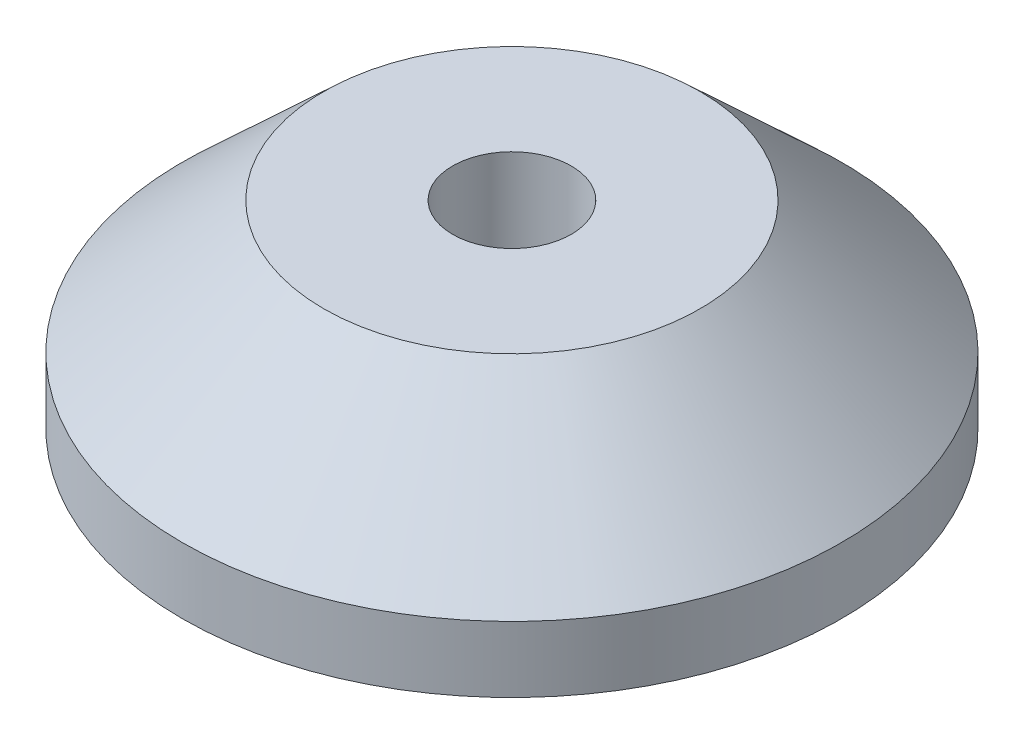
ISO-10303-21;
HEADER;
FILE_DESCRIPTION(('STEP AP214'),'2;1');
FILE_NAME('part.step','',(''),(''),'','','');
FILE_SCHEMA(('AUTOMOTIVE_DESIGN { 1 0 10303 214 1 1 1 1 }'));
ENDSEC;
DATA;
#1=APPLICATION_CONTEXT('core data for automotive mechanical design processes');
#2=APPLICATION_PROTOCOL_DEFINITION('international standard','automotive_design',2000,#1);
#3=PRODUCT_CONTEXT('',#1,'mechanical');
#4=PRODUCT('Part','Part','',(#3));
#5=PRODUCT_RELATED_PRODUCT_CATEGORY('part','',(#4));
#6=PRODUCT_DEFINITION_FORMATION('','',#4);
#7=PRODUCT_DEFINITION_CONTEXT('part definition',#1,'design');
#8=PRODUCT_DEFINITION('design','',#6,#7);
#9=PRODUCT_DEFINITION_SHAPE('','',#8);
#10=(LENGTH_UNIT() NAMED_UNIT(*) SI_UNIT(.MILLI.,.METRE.));
#11=(NAMED_UNIT(*) PLANE_ANGLE_UNIT() SI_UNIT($,.RADIAN.));
#12=(NAMED_UNIT(*) SI_UNIT($,.STERADIAN.) SOLID_ANGLE_UNIT());
#13=UNCERTAINTY_MEASURE_WITH_UNIT(LENGTH_MEASURE(1.E-05),#10,'distance_accuracy_value','');
#14=(GEOMETRIC_REPRESENTATION_CONTEXT(3) GLOBAL_UNCERTAINTY_ASSIGNED_CONTEXT((#13)) GLOBAL_UNIT_ASSIGNED_CONTEXT((#10,
#11,#12)) REPRESENTATION_CONTEXT('',''));
#15=CARTESIAN_POINT('',(0.,0.,0.));
#16=DIRECTION('',(0.,0.,1.));
#17=DIRECTION('',(1.,0.,0.));
#18=AXIS2_PLACEMENT_3D('',#15,#16,#17);
#19=CARTESIAN_POINT('',(0.,10.,0.));
#20=DIRECTION('',(0.,-1.,0.));
#21=DIRECTION('',(0.,0.,1.));
#22=AXIS2_PLACEMENT_3D('',#19,#20,#21);
#23=CONICAL_SURFACE('',#22,50.,0.820304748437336);
#24=CARTESIAN_POINT('',(0.,10.,0.));
#25=DIRECTION('',(0.,1.,0.));
#26=DIRECTION('',(0.,0.,1.));
#27=AXIS2_PLACEMENT_3D('',#24,#25,#26);
#28=CIRCLE('',#27,50.);
#29=CARTESIAN_POINT('',(0.,10.,50.));
#30=VERTEX_POINT('',#29);
#31=EDGE_CURVE('E10',#30,#30,#28,.T.);
#32=ORIENTED_EDGE('',*,*,#31,.T.);
#33=EDGE_LOOP('',(#32));
#34=FACE_BOUND('',#33,.T.);
#35=CARTESIAN_POINT('',(0.,30.,0.));
#36=DIRECTION('',(0.,1.,0.));
#37=DIRECTION('',(0.,0.,1.));
#38=AXIS2_PLACEMENT_3D('',#35,#36,#37);
#39=CIRCLE('',#38,28.5526257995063);
#40=CARTESIAN_POINT('',(0.,30.,28.5526257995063));
#41=VERTEX_POINT('',#40);
#42=EDGE_CURVE('E59',#41,#41,#39,.T.);
#43=ORIENTED_EDGE('',*,*,#42,.F.);
#44=EDGE_LOOP('',(#43));
#45=FACE_BOUND('',#44,.T.);
#46=ADVANCED_FACE('F39',(#34,#45),#23,.T.);
#47=CARTESIAN_POINT('',(0.,10.,0.));
#48=DIRECTION('',(0.,-1.,0.));
#49=DIRECTION('',(0.,0.,-1.));
#50=AXIS2_PLACEMENT_3D('',#47,#48,#49);
#51=CYLINDRICAL_SURFACE('',#50,50.);
#52=ORIENTED_EDGE('',*,*,#31,.F.);
#53=EDGE_LOOP('',(#52));
#54=FACE_BOUND('',#53,.T.);
#55=CARTESIAN_POINT('',(0.,0.,0.));
#56=DIRECTION('',(0.,1.,0.));
#57=DIRECTION('',(0.,0.,1.));
#58=AXIS2_PLACEMENT_3D('',#55,#56,#57);
#59=CIRCLE('',#58,50.);
#60=CARTESIAN_POINT('',(0.,0.,50.));
#61=VERTEX_POINT('',#60);
#62=EDGE_CURVE('E48',#61,#61,#59,.T.);
#63=ORIENTED_EDGE('',*,*,#62,.T.);
#64=EDGE_LOOP('',(#63));
#65=FACE_BOUND('',#64,.T.);
#66=ADVANCED_FACE('F41',(#54,#65),#51,.T.);
#67=CARTESIAN_POINT('',(0.,0.,0.));
#68=DIRECTION('',(0.,1.,0.));
#69=DIRECTION('',(0.,0.,1.));
#70=AXIS2_PLACEMENT_3D('',#67,#68,#69);
#71=PLANE('',#70);
#72=ORIENTED_EDGE('',*,*,#62,.F.);
#73=EDGE_LOOP('',(#72));
#74=FACE_BOUND('',#73,.T.);
#75=ADVANCED_FACE('F86',(#74),#71,.F.);
#76=CARTESIAN_POINT('',(0.,30.,0.));
#77=DIRECTION('',(0.,1.,0.));
#78=DIRECTION('',(0.,0.,1.));
#79=AXIS2_PLACEMENT_3D('',#76,#77,#78);
#80=PLANE('',#79);
#81=CARTESIAN_POINT('',(0.,30.,0.));
#82=DIRECTION('',(0.,1.,0.));
#83=DIRECTION('',(0.,0.,1.));
#84=AXIS2_PLACEMENT_3D('',#81,#82,#83);
#85=CIRCLE('',#84,9.);
#86=CARTESIAN_POINT('',(0.,30.,9.));
#87=VERTEX_POINT('',#86);
#88=EDGE_CURVE('E43',#87,#87,#85,.F.);
#89=ORIENTED_EDGE('',*,*,#88,.T.);
#90=EDGE_LOOP('',(#89));
#91=FACE_BOUND('',#90,.T.);
#92=ORIENTED_EDGE('',*,*,#42,.T.);
#93=EDGE_LOOP('',(#92));
#94=FACE_BOUND('',#93,.T.);
#95=ADVANCED_FACE('F68',(#91,#94),#80,.T.);
#96=CARTESIAN_POINT('',(0.,11.,0.));
#97=DIRECTION('',(0.,1.,0.));
#98=DIRECTION('',(0.,0.,1.));
#99=AXIS2_PLACEMENT_3D('',#96,#97,#98);
#100=PLANE('',#99);
#101=CARTESIAN_POINT('',(0.,11.,0.));
#102=DIRECTION('',(0.,1.,0.));
#103=DIRECTION('',(0.,0.,1.));
#104=AXIS2_PLACEMENT_3D('',#101,#102,#103);
#105=CIRCLE('',#104,9.);
#106=CARTESIAN_POINT('',(0.,11.,9.));
#107=VERTEX_POINT('',#106);
#108=EDGE_CURVE('E54',#107,#107,#105,.T.);
#109=ORIENTED_EDGE('',*,*,#108,.T.);
#110=EDGE_LOOP('',(#109));
#111=FACE_BOUND('',#110,.T.);
#112=ADVANCED_FACE('F72',(#111),#100,.T.);
#113=CARTESIAN_POINT('',(0.,11.,0.));
#114=DIRECTION('',(0.,1.,0.));
#115=DIRECTION('',(0.,0.,1.));
#116=AXIS2_PLACEMENT_3D('',#113,#114,#115);
#117=CYLINDRICAL_SURFACE('',#116,9.);
#118=ORIENTED_EDGE('',*,*,#108,.F.);
#119=EDGE_LOOP('',(#118));
#120=FACE_BOUND('',#119,.T.);
#121=ORIENTED_EDGE('',*,*,#88,.F.);
#122=EDGE_LOOP('',(#121));
#123=FACE_BOUND('',#122,.T.);
#124=ADVANCED_FACE('F70',(#120,#123),#117,.F.);
#125=CLOSED_SHELL('',(#46,#66,#75,#95,#112,#124));
#126=MANIFOLD_SOLID_BREP('B2',#125);
#127=ADVANCED_BREP_SHAPE_REPRESENTATION('',(#18,#126),#14);
#128=SHAPE_DEFINITION_REPRESENTATION(#9,#127);
ENDSEC;
END-ISO-10303-21;
